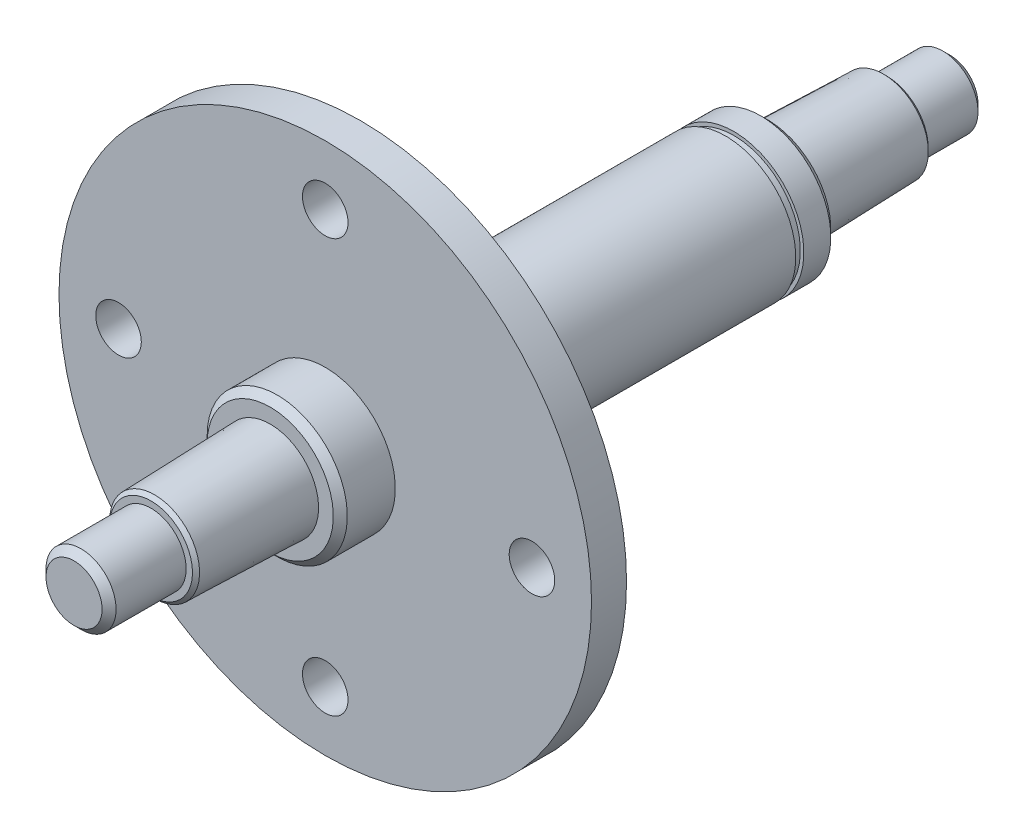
ISO-10303-21;
HEADER;
FILE_DESCRIPTION(('STEP AP214'),'2;1');
FILE_NAME('part.step','',(''),(''),'','','');
FILE_SCHEMA(('AUTOMOTIVE_DESIGN { 1 0 10303 214 1 1 1 1 }'));
ENDSEC;
DATA;
#1=APPLICATION_CONTEXT('core data for automotive mechanical design processes');
#2=APPLICATION_PROTOCOL_DEFINITION('international standard','automotive_design',2000,#1);
#3=PRODUCT_CONTEXT('',#1,'mechanical');
#4=PRODUCT('Part','Part','',(#3));
#5=PRODUCT_RELATED_PRODUCT_CATEGORY('part','',(#4));
#6=PRODUCT_DEFINITION_FORMATION('','',#4);
#7=PRODUCT_DEFINITION_CONTEXT('part definition',#1,'design');
#8=PRODUCT_DEFINITION('design','',#6,#7);
#9=PRODUCT_DEFINITION_SHAPE('','',#8);
#10=(LENGTH_UNIT() NAMED_UNIT(*) SI_UNIT(.MILLI.,.METRE.));
#11=(NAMED_UNIT(*) PLANE_ANGLE_UNIT() SI_UNIT($,.RADIAN.));
#12=(NAMED_UNIT(*) SI_UNIT($,.STERADIAN.) SOLID_ANGLE_UNIT());
#13=UNCERTAINTY_MEASURE_WITH_UNIT(LENGTH_MEASURE(1.E-05),#10,'distance_accuracy_value','');
#14=(GEOMETRIC_REPRESENTATION_CONTEXT(3) GLOBAL_UNCERTAINTY_ASSIGNED_CONTEXT((#13)) GLOBAL_UNIT_ASSIGNED_CONTEXT((#10,
#11,#12)) REPRESENTATION_CONTEXT('',''));
#15=CARTESIAN_POINT('',(0.,0.,0.));
#16=DIRECTION('',(0.,0.,1.));
#17=DIRECTION('',(1.,0.,0.));
#18=AXIS2_PLACEMENT_3D('',#15,#16,#17);
#19=CARTESIAN_POINT('',(616.610838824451,139.850859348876,-65.503302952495));
#20=DIRECTION('',(0.,0.,-1.));
#21=DIRECTION('',(-1.,0.,0.));
#22=AXIS2_PLACEMENT_3D('',#19,#20,#21);
#23=CYLINDRICAL_SURFACE('',#22,5.);
#24=CARTESIAN_POINT('',(616.610838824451,139.850859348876,-60.503302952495));
#25=DIRECTION('',(0.,0.,-1.));
#26=DIRECTION('',(-1.,0.,0.));
#27=AXIS2_PLACEMENT_3D('',#24,#25,#26);
#28=CIRCLE('',#27,5.);
#29=CARTESIAN_POINT('',(611.610838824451,139.850859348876,-60.503302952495));
#30=VERTEX_POINT('',#29);
#31=EDGE_CURVE('E10',#30,#30,#28,.F.);
#32=ORIENTED_EDGE('',*,*,#31,.T.);
#33=EDGE_LOOP('',(#32));
#34=FACE_BOUND('',#33,.T.);
#35=CARTESIAN_POINT('',(616.610838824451,139.850859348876,-52.5033029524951));
#36=DIRECTION('',(0.,0.,-1.));
#37=DIRECTION('',(-1.,0.,0.));
#38=AXIS2_PLACEMENT_3D('',#35,#36,#37);
#39=CIRCLE('',#38,5.);
#40=CARTESIAN_POINT('',(611.610838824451,139.850859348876,-52.5033029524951));
#41=VERTEX_POINT('',#40);
#42=EDGE_CURVE('E34',#41,#41,#39,.T.);
#43=ORIENTED_EDGE('',*,*,#42,.T.);
#44=EDGE_LOOP('',(#43));
#45=FACE_BOUND('',#44,.T.);
#46=ADVANCED_FACE('F14',(#34,#45),#23,.T.);
#47=CARTESIAN_POINT('',(616.610838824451,139.850859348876,-65.503302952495));
#48=DIRECTION('',(0.,0.,-1.));
#49=DIRECTION('',(-1.,0.,0.));
#50=AXIS2_PLACEMENT_3D('',#47,#48,#49);
#51=CYLINDRICAL_SURFACE('',#50,5.);
#52=CARTESIAN_POINT('',(616.610838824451,139.850859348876,62.49999999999));
#53=DIRECTION('',(0.,0.,1.));
#54=DIRECTION('',(1.,0.,0.));
#55=AXIS2_PLACEMENT_3D('',#52,#53,#54);
#56=CIRCLE('',#55,5.);
#57=CARTESIAN_POINT('',(621.610838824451,139.850859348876,62.49999999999));
#58=VERTEX_POINT('',#57);
#59=EDGE_CURVE('E29',#58,#58,#56,.F.);
#60=ORIENTED_EDGE('',*,*,#59,.T.);
#61=EDGE_LOOP('',(#60));
#62=FACE_BOUND('',#61,.T.);
#63=CARTESIAN_POINT('',(616.610838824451,139.850859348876,52.4999999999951));
#64=DIRECTION('',(0.,0.,-1.));
#65=DIRECTION('',(-1.,0.,0.));
#66=AXIS2_PLACEMENT_3D('',#63,#64,#65);
#67=CIRCLE('',#66,5.);
#68=CARTESIAN_POINT('',(611.610838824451,139.850859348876,52.4999999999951));
#69=VERTEX_POINT('',#68);
#70=EDGE_CURVE('E54',#69,#69,#67,.T.);
#71=ORIENTED_EDGE('',*,*,#70,.F.);
#72=EDGE_LOOP('',(#71));
#73=FACE_BOUND('',#72,.T.);
#74=ADVANCED_FACE('F169',(#62,#73),#51,.T.);
#75=CARTESIAN_POINT('',(616.610838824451,139.850859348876,-52.5033029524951));
#76=DIRECTION('',(0.,0.,1.));
#77=DIRECTION('',(1.,0.,0.));
#78=AXIS2_PLACEMENT_3D('',#75,#76,#77);
#79=CONICAL_SURFACE('',#78,5.,1.56712639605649);
#80=CARTESIAN_POINT('',(616.610838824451,139.850859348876,-52.5000000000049));
#81=DIRECTION('',(0.,0.,-1.));
#82=DIRECTION('',(-1.,0.,0.));
#83=AXIS2_PLACEMENT_3D('',#80,#81,#82);
#84=CIRCLE('',#83,5.89999999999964);
#85=CARTESIAN_POINT('',(610.710838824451,139.850859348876,-52.5000000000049));
#86=VERTEX_POINT('',#85);
#87=EDGE_CURVE('E51',#86,#86,#84,.T.);
#88=ORIENTED_EDGE('',*,*,#87,.T.);
#89=EDGE_LOOP('',(#88));
#90=FACE_BOUND('',#89,.T.);
#91=ORIENTED_EDGE('',*,*,#42,.F.);
#92=EDGE_LOOP('',(#91));
#93=FACE_BOUND('',#92,.T.);
#94=ADVANCED_FACE('F16',(#90,#93),#79,.T.);
#95=CARTESIAN_POINT('',(616.610838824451,52.6125551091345,52.4999999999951));
#96=DIRECTION('',(0.,0.,1.));
#97=DIRECTION('',(1.,0.,0.));
#98=AXIS2_PLACEMENT_3D('',#95,#96,#97);
#99=PLANE('',#98);
#100=ORIENTED_EDGE('',*,*,#70,.T.);
#101=EDGE_LOOP('',(#100));
#102=FACE_BOUND('',#101,.T.);
#103=CARTESIAN_POINT('',(616.610838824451,139.850859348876,52.4999999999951));
#104=DIRECTION('',(0.,0.,-1.));
#105=DIRECTION('',(-1.,0.,0.));
#106=AXIS2_PLACEMENT_3D('',#103,#104,#105);
#107=CIRCLE('',#106,5.89999999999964);
#108=CARTESIAN_POINT('',(610.710838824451,139.850859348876,52.4999999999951));
#109=VERTEX_POINT('',#108);
#110=EDGE_CURVE('E57',#109,#109,#107,.T.);
#111=ORIENTED_EDGE('',*,*,#110,.F.);
#112=EDGE_LOOP('',(#111));
#113=FACE_BOUND('',#112,.T.);
#114=ADVANCED_FACE('F177',(#102,#113),#99,.T.);
#115=CARTESIAN_POINT('',(616.610838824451,139.850859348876,52.0002161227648));
#116=DIRECTION('',(0.,0.,-1.));
#117=DIRECTION('',(-1.,0.,0.));
#118=AXIS2_PLACEMENT_3D('',#115,#116,#117);
#119=CONICAL_SURFACE('',#118,6.41469952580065,0.800099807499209);
#120=ORIENTED_EDGE('',*,*,#110,.T.);
#121=EDGE_LOOP('',(#120));
#122=FACE_BOUND('',#121,.T.);
#123=CARTESIAN_POINT('',(616.610838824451,139.850859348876,52.0002161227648));
#124=DIRECTION('',(0.,0.,-1.));
#125=DIRECTION('',(-1.,0.,0.));
#126=AXIS2_PLACEMENT_3D('',#123,#124,#125);
#127=CIRCLE('',#126,6.41469952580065);
#128=CARTESIAN_POINT('',(610.19613929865,139.850859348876,52.0002161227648));
#129=VERTEX_POINT('',#128);
#130=EDGE_CURVE('E60',#129,#129,#127,.T.);
#131=ORIENTED_EDGE('',*,*,#130,.F.);
#132=EDGE_LOOP('',(#131));
#133=FACE_BOUND('',#132,.T.);
#134=ADVANCED_FACE('F180',(#122,#133),#119,.T.);
#135=CARTESIAN_POINT('',(616.610838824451,139.850859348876,35.499999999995));
#136=DIRECTION('',(0.,0.,-1.));
#137=DIRECTION('',(-1.,0.,0.));
#138=AXIS2_PLACEMENT_3D('',#135,#136,#137);
#139=CONICAL_SURFACE('',#138,6.89999999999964,0.0294032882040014);
#140=ORIENTED_EDGE('',*,*,#130,.T.);
#141=EDGE_LOOP('',(#140));
#142=FACE_BOUND('',#141,.T.);
#143=CARTESIAN_POINT('',(616.610838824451,139.850859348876,35.499999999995));
#144=DIRECTION('',(0.,0.,-1.));
#145=DIRECTION('',(-1.,0.,0.));
#146=AXIS2_PLACEMENT_3D('',#143,#144,#145);
#147=CIRCLE('',#146,6.89999999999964);
#148=CARTESIAN_POINT('',(609.710838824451,139.850859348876,35.499999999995));
#149=VERTEX_POINT('',#148);
#150=EDGE_CURVE('E63',#149,#149,#147,.T.);
#151=ORIENTED_EDGE('',*,*,#150,.F.);
#152=EDGE_LOOP('',(#151));
#153=FACE_BOUND('',#152,.T.);
#154=ADVANCED_FACE('F184',(#142,#153),#139,.T.);
#155=CARTESIAN_POINT('',(616.610838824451,52.6125551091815,35.499999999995));
#156=DIRECTION('',(0.,0.,1.));
#157=DIRECTION('',(1.,0.,0.));
#158=AXIS2_PLACEMENT_3D('',#155,#156,#157);
#159=PLANE('',#158);
#160=ORIENTED_EDGE('',*,*,#150,.T.);
#161=EDGE_LOOP('',(#160));
#162=FACE_BOUND('',#161,.T.);
#163=CARTESIAN_POINT('',(616.610838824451,139.850859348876,35.4999999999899));
#164=DIRECTION('',(0.,0.,-1.));
#165=DIRECTION('',(-1.,0.,0.));
#166=AXIS2_PLACEMENT_3D('',#163,#164,#165);
#167=CIRCLE('',#166,9.);
#168=CARTESIAN_POINT('',(607.610838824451,139.850859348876,35.4999999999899));
#169=VERTEX_POINT('',#168);
#170=EDGE_CURVE('E66',#169,#169,#167,.T.);
#171=ORIENTED_EDGE('',*,*,#170,.F.);
#172=EDGE_LOOP('',(#171));
#173=FACE_BOUND('',#172,.T.);
#174=ADVANCED_FACE('F188',(#162,#173),#159,.T.);
#175=CARTESIAN_POINT('',(616.610838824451,139.850859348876,35.4999999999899));
#176=DIRECTION('',(0.,0.,-1.));
#177=DIRECTION('',(-1.,0.,0.));
#178=AXIS2_PLACEMENT_3D('',#175,#176,#177);
#179=CONICAL_SURFACE('',#178,9.,0.785398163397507);
#180=CARTESIAN_POINT('',(616.610838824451,139.850859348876,34.49999999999));
#181=DIRECTION('',(0.,0.,-1.));
#182=DIRECTION('',(-1.,0.,0.));
#183=AXIS2_PLACEMENT_3D('',#180,#181,#182);
#184=CIRCLE('',#183,10.);
#185=CARTESIAN_POINT('',(606.610838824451,139.850859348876,34.49999999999));
#186=VERTEX_POINT('',#185);
#187=EDGE_CURVE('E69',#186,#186,#184,.T.);
#188=ORIENTED_EDGE('',*,*,#187,.F.);
#189=EDGE_LOOP('',(#188));
#190=FACE_BOUND('',#189,.T.);
#191=ORIENTED_EDGE('',*,*,#170,.T.);
#192=EDGE_LOOP('',(#191));
#193=FACE_BOUND('',#192,.T.);
#194=ADVANCED_FACE('F192',(#190,#193),#179,.T.);
#195=CARTESIAN_POINT('',(616.610838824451,139.850859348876,-65.503302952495));
#196=DIRECTION('',(0.,0.,-1.));
#197=DIRECTION('',(-1.,0.,0.));
#198=AXIS2_PLACEMENT_3D('',#195,#196,#197);
#199=CYLINDRICAL_SURFACE('',#198,9.99999999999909);
#200=CARTESIAN_POINT('',(616.610838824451,139.850859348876,27.649999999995));
#201=DIRECTION('',(0.,0.,-1.));
#202=DIRECTION('',(-1.,0.,0.));
#203=AXIS2_PLACEMENT_3D('',#200,#201,#202);
#204=CIRCLE('',#203,9.99999999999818);
#205=CARTESIAN_POINT('',(606.610838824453,139.850859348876,27.649999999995));
#206=VERTEX_POINT('',#205);
#207=EDGE_CURVE('E72',#206,#206,#204,.T.);
#208=ORIENTED_EDGE('',*,*,#207,.F.);
#209=EDGE_LOOP('',(#208));
#210=FACE_BOUND('',#209,.T.);
#211=ORIENTED_EDGE('',*,*,#187,.T.);
#212=EDGE_LOOP('',(#211));
#213=FACE_BOUND('',#212,.T.);
#214=ADVANCED_FACE('F138',(#210,#213),#199,.T.);
#215=CARTESIAN_POINT('',(616.610838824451,52.6125551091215,27.649999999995));
#216=DIRECTION('',(0.,0.,1.));
#217=DIRECTION('',(1.,0.,0.));
#218=AXIS2_PLACEMENT_3D('',#215,#216,#217);
#219=PLANE('',#218);
#220=CARTESIAN_POINT('',(646.110838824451,139.850859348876,27.649999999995));
#221=DIRECTION('',(0.,0.,1.));
#222=DIRECTION('',(0.,-1.,0.));
#223=AXIS2_PLACEMENT_3D('',#220,#221,#222);
#224=CIRCLE('',#223,3.25);
#225=CARTESIAN_POINT('',(646.110838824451,136.600859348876,27.649999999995));
#226=VERTEX_POINT('',#225);
#227=EDGE_CURVE('E39',#226,#226,#224,.T.);
#228=ORIENTED_EDGE('',*,*,#227,.F.);
#229=EDGE_LOOP('',(#228));
#230=FACE_BOUND('',#229,.T.);
#231=CARTESIAN_POINT('',(616.610838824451,110.350859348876,27.649999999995));
#232=DIRECTION('',(0.,0.,1.));
#233=DIRECTION('',(-1.,0.,0.));
#234=AXIS2_PLACEMENT_3D('',#231,#232,#233);
#235=CIRCLE('',#234,3.25);
#236=CARTESIAN_POINT('',(613.360838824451,110.350859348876,27.649999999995));
#237=VERTEX_POINT('',#236);
#238=EDGE_CURVE('E38',#237,#237,#235,.T.);
#239=ORIENTED_EDGE('',*,*,#238,.F.);
#240=EDGE_LOOP('',(#239));
#241=FACE_BOUND('',#240,.T.);
#242=CARTESIAN_POINT('',(587.110838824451,139.850859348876,27.649999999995));
#243=DIRECTION('',(0.,0.,1.));
#244=DIRECTION('',(0.,1.,0.));
#245=AXIS2_PLACEMENT_3D('',#242,#243,#244);
#246=CIRCLE('',#245,3.25);
#247=CARTESIAN_POINT('',(587.110838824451,143.100859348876,27.649999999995));
#248=VERTEX_POINT('',#247);
#249=EDGE_CURVE('E43',#248,#248,#246,.T.);
#250=ORIENTED_EDGE('',*,*,#249,.F.);
#251=EDGE_LOOP('',(#250));
#252=FACE_BOUND('',#251,.T.);
#253=CARTESIAN_POINT('',(616.610838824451,169.350859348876,27.649999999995));
#254=DIRECTION('',(0.,0.,1.));
#255=DIRECTION('',(1.,0.,0.));
#256=AXIS2_PLACEMENT_3D('',#253,#254,#255);
#257=CIRCLE('',#256,3.25);
#258=CARTESIAN_POINT('',(619.860838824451,169.350859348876,27.649999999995));
#259=VERTEX_POINT('',#258);
#260=EDGE_CURVE('E47',#259,#259,#257,.T.);
#261=ORIENTED_EDGE('',*,*,#260,.F.);
#262=EDGE_LOOP('',(#261));
#263=FACE_BOUND('',#262,.T.);
#264=ORIENTED_EDGE('',*,*,#207,.T.);
#265=EDGE_LOOP('',(#264));
#266=FACE_BOUND('',#265,.T.);
#267=CARTESIAN_POINT('',(616.610838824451,139.850859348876,27.649999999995));
#268=DIRECTION('',(0.,0.,-1.));
#269=DIRECTION('',(-1.,0.,0.));
#270=AXIS2_PLACEMENT_3D('',#267,#268,#269);
#271=CIRCLE('',#270,38.);
#272=CARTESIAN_POINT('',(578.610838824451,139.850859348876,27.6499999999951));
#273=VERTEX_POINT('',#272);
#274=EDGE_CURVE('E75',#273,#273,#271,.T.);
#275=ORIENTED_EDGE('',*,*,#274,.F.);
#276=EDGE_LOOP('',(#275));
#277=FACE_BOUND('',#276,.T.);
#278=ADVANCED_FACE('F134',(#230,#241,#252,#263,#266,#277),#219,.T.);
#279=CARTESIAN_POINT('',(616.610838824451,139.850859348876,-65.503302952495));
#280=DIRECTION('',(0.,0.,-1.));
#281=DIRECTION('',(-1.,0.,0.));
#282=AXIS2_PLACEMENT_3D('',#279,#280,#281);
#283=CYLINDRICAL_SURFACE('',#282,38.);
#284=ORIENTED_EDGE('',*,*,#274,.T.);
#285=EDGE_LOOP('',(#284));
#286=FACE_BOUND('',#285,.T.);
#287=CARTESIAN_POINT('',(616.610838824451,139.850859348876,22.649999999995));
#288=DIRECTION('',(0.,0.,-1.));
#289=DIRECTION('',(-1.,0.,0.));
#290=AXIS2_PLACEMENT_3D('',#287,#288,#289);
#291=CIRCLE('',#290,38.);
#292=CARTESIAN_POINT('',(578.610838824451,139.850859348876,22.649999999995));
#293=VERTEX_POINT('',#292);
#294=EDGE_CURVE('E78',#293,#293,#291,.T.);
#295=ORIENTED_EDGE('',*,*,#294,.F.);
#296=EDGE_LOOP('',(#295));
#297=FACE_BOUND('',#296,.T.);
#298=ADVANCED_FACE('F137',(#286,#297),#283,.T.);
#299=CARTESIAN_POINT('',(616.610838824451,52.6125551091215,22.649999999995));
#300=DIRECTION('',(0.,0.,1.));
#301=DIRECTION('',(1.,0.,0.));
#302=AXIS2_PLACEMENT_3D('',#299,#300,#301);
#303=PLANE('',#302);
#304=CARTESIAN_POINT('',(646.110838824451,139.850859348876,22.649999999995));
#305=DIRECTION('',(0.,0.,1.));
#306=DIRECTION('',(1.,0.,0.));
#307=AXIS2_PLACEMENT_3D('',#304,#305,#306);
#308=CIRCLE('',#307,3.25);
#309=CARTESIAN_POINT('',(649.360838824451,139.850859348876,22.649999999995));
#310=VERTEX_POINT('',#309);
#311=EDGE_CURVE('E35',#310,#310,#308,.T.);
#312=ORIENTED_EDGE('',*,*,#311,.T.);
#313=EDGE_LOOP('',(#312));
#314=FACE_BOUND('',#313,.T.);
#315=CARTESIAN_POINT('',(616.610838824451,110.350859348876,22.649999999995));
#316=DIRECTION('',(0.,0.,1.));
#317=DIRECTION('',(1.,0.,0.));
#318=AXIS2_PLACEMENT_3D('',#315,#316,#317);
#319=CIRCLE('',#318,3.25);
#320=CARTESIAN_POINT('',(619.860838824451,110.350859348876,22.649999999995));
#321=VERTEX_POINT('',#320);
#322=EDGE_CURVE('E40',#321,#321,#319,.T.);
#323=ORIENTED_EDGE('',*,*,#322,.T.);
#324=EDGE_LOOP('',(#323));
#325=FACE_BOUND('',#324,.T.);
#326=CARTESIAN_POINT('',(587.110838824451,139.850859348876,22.649999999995));
#327=DIRECTION('',(0.,0.,1.));
#328=DIRECTION('',(1.,0.,0.));
#329=AXIS2_PLACEMENT_3D('',#326,#327,#328);
#330=CIRCLE('',#329,3.25);
#331=CARTESIAN_POINT('',(590.360838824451,139.850859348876,22.649999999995));
#332=VERTEX_POINT('',#331);
#333=EDGE_CURVE('E44',#332,#332,#330,.T.);
#334=ORIENTED_EDGE('',*,*,#333,.T.);
#335=EDGE_LOOP('',(#334));
#336=FACE_BOUND('',#335,.T.);
#337=CARTESIAN_POINT('',(616.610838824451,169.350859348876,22.649999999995));
#338=DIRECTION('',(0.,0.,1.));
#339=DIRECTION('',(1.,0.,0.));
#340=AXIS2_PLACEMENT_3D('',#337,#338,#339);
#341=CIRCLE('',#340,3.25);
#342=CARTESIAN_POINT('',(619.860838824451,169.350859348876,22.649999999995));
#343=VERTEX_POINT('',#342);
#344=EDGE_CURVE('E48',#343,#343,#341,.T.);
#345=ORIENTED_EDGE('',*,*,#344,.T.);
#346=EDGE_LOOP('',(#345));
#347=FACE_BOUND('',#346,.T.);
#348=CARTESIAN_POINT('',(616.610838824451,139.850859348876,22.649999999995));
#349=DIRECTION('',(0.,0.,-1.));
#350=DIRECTION('',(-1.,0.,0.));
#351=AXIS2_PLACEMENT_3D('',#348,#349,#350);
#352=CIRCLE('',#351,10.);
#353=CARTESIAN_POINT('',(606.610838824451,139.850859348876,22.649999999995));
#354=VERTEX_POINT('',#353);
#355=EDGE_CURVE('E81',#354,#354,#352,.T.);
#356=ORIENTED_EDGE('',*,*,#355,.F.);
#357=EDGE_LOOP('',(#356));
#358=FACE_BOUND('',#357,.T.);
#359=ORIENTED_EDGE('',*,*,#294,.T.);
#360=EDGE_LOOP('',(#359));
#361=FACE_BOUND('',#360,.T.);
#362=ADVANCED_FACE('F152',(#314,#325,#336,#347,#358,#361),#303,.F.);
#363=CARTESIAN_POINT('',(616.610838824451,139.850859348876,-65.503302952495));
#364=DIRECTION('',(0.,0.,-1.));
#365=DIRECTION('',(-1.,0.,0.));
#366=AXIS2_PLACEMENT_3D('',#363,#364,#365);
#367=CYLINDRICAL_SURFACE('',#366,10.);
#368=CARTESIAN_POINT('',(616.610838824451,139.850859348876,17.6499999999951));
#369=DIRECTION('',(0.,0.,-1.));
#370=DIRECTION('',(-1.,0.,0.));
#371=AXIS2_PLACEMENT_3D('',#368,#369,#370);
#372=CIRCLE('',#371,10.);
#373=CARTESIAN_POINT('',(606.610838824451,139.850859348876,17.6499999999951));
#374=VERTEX_POINT('',#373);
#375=EDGE_CURVE('E84',#374,#374,#372,.T.);
#376=ORIENTED_EDGE('',*,*,#375,.F.);
#377=EDGE_LOOP('',(#376));
#378=FACE_BOUND('',#377,.T.);
#379=ORIENTED_EDGE('',*,*,#355,.T.);
#380=EDGE_LOOP('',(#379));
#381=FACE_BOUND('',#380,.T.);
#382=ADVANCED_FACE('F157',(#378,#381),#367,.T.);
#383=CARTESIAN_POINT('',(616.610838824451,52.6125551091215,17.6499999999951));
#384=DIRECTION('',(0.,0.,1.));
#385=DIRECTION('',(1.,0.,0.));
#386=AXIS2_PLACEMENT_3D('',#383,#384,#385);
#387=PLANE('',#386);
#388=CARTESIAN_POINT('',(616.610838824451,139.850859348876,17.6499999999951));
#389=DIRECTION('',(0.,0.,-1.));
#390=DIRECTION('',(-1.,0.,0.));
#391=AXIS2_PLACEMENT_3D('',#388,#389,#390);
#392=CIRCLE('',#391,9.5);
#393=CARTESIAN_POINT('',(607.110838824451,139.850859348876,17.6499999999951));
#394=VERTEX_POINT('',#393);
#395=EDGE_CURVE('E87',#394,#394,#392,.T.);
#396=ORIENTED_EDGE('',*,*,#395,.F.);
#397=EDGE_LOOP('',(#396));
#398=FACE_BOUND('',#397,.T.);
#399=ORIENTED_EDGE('',*,*,#375,.T.);
#400=EDGE_LOOP('',(#399));
#401=FACE_BOUND('',#400,.T.);
#402=ADVANCED_FACE('F164',(#398,#401),#387,.F.);
#403=CARTESIAN_POINT('',(616.610838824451,139.850859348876,-65.503302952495));
#404=DIRECTION('',(0.,0.,-1.));
#405=DIRECTION('',(-1.,0.,0.));
#406=AXIS2_PLACEMENT_3D('',#403,#404,#405);
#407=CYLINDRICAL_SURFACE('',#406,9.5);
#408=CARTESIAN_POINT('',(616.610838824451,139.850859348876,16.4999999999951));
#409=DIRECTION('',(0.,0.,-1.));
#410=DIRECTION('',(-1.,0.,0.));
#411=AXIS2_PLACEMENT_3D('',#408,#409,#410);
#412=CIRCLE('',#411,9.5);
#413=CARTESIAN_POINT('',(607.110838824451,139.850859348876,16.4999999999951));
#414=VERTEX_POINT('',#413);
#415=EDGE_CURVE('E90',#414,#414,#412,.T.);
#416=ORIENTED_EDGE('',*,*,#415,.F.);
#417=EDGE_LOOP('',(#416));
#418=FACE_BOUND('',#417,.T.);
#419=ORIENTED_EDGE('',*,*,#395,.T.);
#420=EDGE_LOOP('',(#419));
#421=FACE_BOUND('',#420,.T.);
#422=ADVANCED_FACE('F244',(#418,#421),#407,.T.);
#423=CARTESIAN_POINT('',(616.610838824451,52.6125551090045,16.5));
#424=DIRECTION('',(0.,0.,1.));
#425=DIRECTION('',(1.,0.,0.));
#426=AXIS2_PLACEMENT_3D('',#423,#424,#425);
#427=PLANE('',#426);
#428=ORIENTED_EDGE('',*,*,#415,.T.);
#429=EDGE_LOOP('',(#428));
#430=FACE_BOUND('',#429,.T.);
#431=CARTESIAN_POINT('',(616.610838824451,139.850859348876,16.5));
#432=DIRECTION('',(0.,0.,-1.));
#433=DIRECTION('',(-1.,0.,0.));
#434=AXIS2_PLACEMENT_3D('',#431,#432,#433);
#435=CIRCLE('',#434,10.);
#436=CARTESIAN_POINT('',(606.610838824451,139.850859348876,16.5));
#437=VERTEX_POINT('',#436);
#438=EDGE_CURVE('E93',#437,#437,#435,.T.);
#439=ORIENTED_EDGE('',*,*,#438,.F.);
#440=EDGE_LOOP('',(#439));
#441=FACE_BOUND('',#440,.T.);
#442=ADVANCED_FACE('F254',(#430,#441),#427,.T.);
#443=CARTESIAN_POINT('',(616.610838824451,139.850859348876,-65.503302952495));
#444=DIRECTION('',(0.,0.,-1.));
#445=DIRECTION('',(-1.,0.,0.));
#446=AXIS2_PLACEMENT_3D('',#443,#444,#445);
#447=CYLINDRICAL_SURFACE('',#446,10.);
#448=CARTESIAN_POINT('',(616.610838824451,139.850859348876,-29.5000000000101));
#449=DIRECTION('',(0.,0.,-1.));
#450=DIRECTION('',(-1.,0.,0.));
#451=AXIS2_PLACEMENT_3D('',#448,#449,#450);
#452=CIRCLE('',#451,10.);
#453=CARTESIAN_POINT('',(606.610838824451,139.850859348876,-29.5000000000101));
#454=VERTEX_POINT('',#453);
#455=EDGE_CURVE('E96',#454,#454,#452,.T.);
#456=ORIENTED_EDGE('',*,*,#455,.F.);
#457=EDGE_LOOP('',(#456));
#458=FACE_BOUND('',#457,.T.);
#459=ORIENTED_EDGE('',*,*,#438,.T.);
#460=EDGE_LOOP('',(#459));
#461=FACE_BOUND('',#460,.T.);
#462=ADVANCED_FACE('F264',(#458,#461),#447,.T.);
#463=CARTESIAN_POINT('',(616.610838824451,52.612555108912,-29.5000000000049));
#464=DIRECTION('',(0.,0.,1.));
#465=DIRECTION('',(1.,0.,0.));
#466=AXIS2_PLACEMENT_3D('',#463,#464,#465);
#467=PLANE('',#466);
#468=CARTESIAN_POINT('',(616.610838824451,139.850859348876,-29.5000000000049));
#469=DIRECTION('',(0.,0.,-1.));
#470=DIRECTION('',(-1.,0.,0.));
#471=AXIS2_PLACEMENT_3D('',#468,#469,#470);
#472=CIRCLE('',#471,9.5);
#473=CARTESIAN_POINT('',(607.110838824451,139.850859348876,-29.5000000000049));
#474=VERTEX_POINT('',#473);
#475=EDGE_CURVE('E99',#474,#474,#472,.T.);
#476=ORIENTED_EDGE('',*,*,#475,.F.);
#477=EDGE_LOOP('',(#476));
#478=FACE_BOUND('',#477,.T.);
#479=ORIENTED_EDGE('',*,*,#455,.T.);
#480=EDGE_LOOP('',(#479));
#481=FACE_BOUND('',#480,.T.);
#482=ADVANCED_FACE('F275',(#478,#481),#467,.F.);
#483=CARTESIAN_POINT('',(616.610838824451,139.850859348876,-65.503302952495));
#484=DIRECTION('',(0.,0.,-1.));
#485=DIRECTION('',(-1.,0.,0.));
#486=AXIS2_PLACEMENT_3D('',#483,#484,#485);
#487=CYLINDRICAL_SURFACE('',#486,9.5);
#488=CARTESIAN_POINT('',(616.610838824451,139.850859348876,-30.650000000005));
#489=DIRECTION('',(0.,0.,-1.));
#490=DIRECTION('',(-1.,0.,0.));
#491=AXIS2_PLACEMENT_3D('',#488,#489,#490);
#492=CIRCLE('',#491,9.5);
#493=CARTESIAN_POINT('',(607.110838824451,139.850859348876,-30.650000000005));
#494=VERTEX_POINT('',#493);
#495=EDGE_CURVE('E102',#494,#494,#492,.T.);
#496=ORIENTED_EDGE('',*,*,#495,.F.);
#497=EDGE_LOOP('',(#496));
#498=FACE_BOUND('',#497,.T.);
#499=ORIENTED_EDGE('',*,*,#475,.T.);
#500=EDGE_LOOP('',(#499));
#501=FACE_BOUND('',#500,.T.);
#502=ADVANCED_FACE('F285',(#498,#501),#487,.T.);
#503=CARTESIAN_POINT('',(616.610838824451,52.6125551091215,-30.650000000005));
#504=DIRECTION('',(0.,0.,-1.));
#505=DIRECTION('',(-1.,0.,0.));
#506=AXIS2_PLACEMENT_3D('',#503,#504,#505);
#507=PLANE('',#506);
#508=CARTESIAN_POINT('',(616.610838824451,139.850859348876,-30.650000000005));
#509=DIRECTION('',(0.,0.,-1.));
#510=DIRECTION('',(-1.,0.,0.));
#511=AXIS2_PLACEMENT_3D('',#508,#509,#510);
#512=CIRCLE('',#511,10.);
#513=CARTESIAN_POINT('',(606.610838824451,139.850859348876,-30.650000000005));
#514=VERTEX_POINT('',#513);
#515=EDGE_CURVE('E105',#514,#514,#512,.T.);
#516=ORIENTED_EDGE('',*,*,#515,.F.);
#517=EDGE_LOOP('',(#516));
#518=FACE_BOUND('',#517,.T.);
#519=ORIENTED_EDGE('',*,*,#495,.T.);
#520=EDGE_LOOP('',(#519));
#521=FACE_BOUND('',#520,.T.);
#522=ADVANCED_FACE('F295',(#518,#521),#507,.F.);
#523=CARTESIAN_POINT('',(616.610838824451,139.850859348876,-65.503302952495));
#524=DIRECTION('',(0.,0.,-1.));
#525=DIRECTION('',(-1.,0.,0.));
#526=AXIS2_PLACEMENT_3D('',#523,#524,#525);
#527=CYLINDRICAL_SURFACE('',#526,10.);
#528=CARTESIAN_POINT('',(616.610838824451,139.850859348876,-34.5000000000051));
#529=DIRECTION('',(0.,0.,-1.));
#530=DIRECTION('',(-1.,0.,0.));
#531=AXIS2_PLACEMENT_3D('',#528,#529,#530);
#532=CIRCLE('',#531,10.);
#533=CARTESIAN_POINT('',(606.610838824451,139.850859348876,-34.5000000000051));
#534=VERTEX_POINT('',#533);
#535=EDGE_CURVE('E108',#534,#534,#532,.T.);
#536=ORIENTED_EDGE('',*,*,#535,.F.);
#537=EDGE_LOOP('',(#536));
#538=FACE_BOUND('',#537,.T.);
#539=ORIENTED_EDGE('',*,*,#515,.T.);
#540=EDGE_LOOP('',(#539));
#541=FACE_BOUND('',#540,.T.);
#542=ADVANCED_FACE('F305',(#538,#541),#527,.T.);
#543=CARTESIAN_POINT('',(616.610838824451,139.850859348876,-34.5000000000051));
#544=DIRECTION('',(0.,0.,1.));
#545=DIRECTION('',(1.,0.,0.));
#546=AXIS2_PLACEMENT_3D('',#543,#544,#545);
#547=CONICAL_SURFACE('',#546,10.,0.785398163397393);
#548=CARTESIAN_POINT('',(616.610838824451,139.850859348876,-35.500000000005));
#549=DIRECTION('',(0.,0.,-1.));
#550=DIRECTION('',(-1.,0.,0.));
#551=AXIS2_PLACEMENT_3D('',#548,#549,#550);
#552=CIRCLE('',#551,9.);
#553=CARTESIAN_POINT('',(607.610838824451,139.850859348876,-35.500000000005));
#554=VERTEX_POINT('',#553);
#555=EDGE_CURVE('E111',#554,#554,#552,.T.);
#556=ORIENTED_EDGE('',*,*,#555,.F.);
#557=EDGE_LOOP('',(#556));
#558=FACE_BOUND('',#557,.T.);
#559=ORIENTED_EDGE('',*,*,#535,.T.);
#560=EDGE_LOOP('',(#559));
#561=FACE_BOUND('',#560,.T.);
#562=ADVANCED_FACE('F315',(#558,#561),#547,.T.);
#563=CARTESIAN_POINT('',(616.610838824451,52.6125551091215,-35.500000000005));
#564=DIRECTION('',(0.,0.,1.));
#565=DIRECTION('',(1.,0.,0.));
#566=AXIS2_PLACEMENT_3D('',#563,#564,#565);
#567=PLANE('',#566);
#568=CARTESIAN_POINT('',(616.610838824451,139.850859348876,-35.500000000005));
#569=DIRECTION('',(0.,0.,-1.));
#570=DIRECTION('',(-1.,0.,0.));
#571=AXIS2_PLACEMENT_3D('',#568,#569,#570);
#572=CIRCLE('',#571,6.89999999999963);
#573=CARTESIAN_POINT('',(609.710838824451,139.850859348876,-35.500000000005));
#574=VERTEX_POINT('',#573);
#575=EDGE_CURVE('E114',#574,#574,#572,.T.);
#576=ORIENTED_EDGE('',*,*,#575,.F.);
#577=EDGE_LOOP('',(#576));
#578=FACE_BOUND('',#577,.T.);
#579=ORIENTED_EDGE('',*,*,#555,.T.);
#580=EDGE_LOOP('',(#579));
#581=FACE_BOUND('',#580,.T.);
#582=ADVANCED_FACE('F325',(#578,#581),#567,.F.);
#583=CARTESIAN_POINT('',(616.610838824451,139.850859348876,-35.500000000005));
#584=DIRECTION('',(0.,0.,1.));
#585=DIRECTION('',(1.,0.,0.));
#586=AXIS2_PLACEMENT_3D('',#583,#584,#585);
#587=CONICAL_SURFACE('',#586,6.89999999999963,0.0294032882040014);
#588=CARTESIAN_POINT('',(616.610838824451,139.850859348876,-52.0002161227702));
#589=DIRECTION('',(0.,0.,-1.));
#590=DIRECTION('',(-1.,0.,0.));
#591=AXIS2_PLACEMENT_3D('',#588,#589,#590);
#592=CIRCLE('',#591,6.41469952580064);
#593=CARTESIAN_POINT('',(610.19613929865,139.850859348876,-52.0002161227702));
#594=VERTEX_POINT('',#593);
#595=EDGE_CURVE('E117',#594,#594,#592,.T.);
#596=ORIENTED_EDGE('',*,*,#595,.F.);
#597=EDGE_LOOP('',(#596));
#598=FACE_BOUND('',#597,.T.);
#599=ORIENTED_EDGE('',*,*,#575,.T.);
#600=EDGE_LOOP('',(#599));
#601=FACE_BOUND('',#600,.T.);
#602=ADVANCED_FACE('F335',(#598,#601),#587,.T.);
#603=CARTESIAN_POINT('',(616.610838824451,139.850859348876,-52.0002161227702));
#604=DIRECTION('',(0.,0.,1.));
#605=DIRECTION('',(1.,0.,0.));
#606=AXIS2_PLACEMENT_3D('',#603,#604,#605);
#607=CONICAL_SURFACE('',#606,6.41469952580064,0.800099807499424);
#608=ORIENTED_EDGE('',*,*,#87,.F.);
#609=EDGE_LOOP('',(#608));
#610=FACE_BOUND('',#609,.T.);
#611=ORIENTED_EDGE('',*,*,#595,.T.);
#612=EDGE_LOOP('',(#611));
#613=FACE_BOUND('',#612,.T.);
#614=ADVANCED_FACE('F345',(#610,#613),#607,.T.);
#615=CARTESIAN_POINT('',(616.610838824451,169.350859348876,-65.503302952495));
#616=DIRECTION('',(0.,0.,1.));
#617=DIRECTION('',(1.,0.,0.));
#618=AXIS2_PLACEMENT_3D('',#615,#616,#617);
#619=CYLINDRICAL_SURFACE('',#618,3.25);
#620=ORIENTED_EDGE('',*,*,#260,.T.);
#621=EDGE_LOOP('',(#620));
#622=FACE_BOUND('',#621,.T.);
#623=ORIENTED_EDGE('',*,*,#344,.F.);
#624=EDGE_LOOP('',(#623));
#625=FACE_BOUND('',#624,.T.);
#626=ADVANCED_FACE('F355',(#622,#625),#619,.F.);
#627=CARTESIAN_POINT('',(587.110838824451,139.850859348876,-65.503302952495));
#628=DIRECTION('',(0.,0.,1.));
#629=DIRECTION('',(1.,0.,0.));
#630=AXIS2_PLACEMENT_3D('',#627,#628,#629);
#631=CYLINDRICAL_SURFACE('',#630,3.25);
#632=ORIENTED_EDGE('',*,*,#249,.T.);
#633=EDGE_LOOP('',(#632));
#634=FACE_BOUND('',#633,.T.);
#635=ORIENTED_EDGE('',*,*,#333,.F.);
#636=EDGE_LOOP('',(#635));
#637=FACE_BOUND('',#636,.T.);
#638=ADVANCED_FACE('F365',(#634,#637),#631,.F.);
#639=CARTESIAN_POINT('',(616.610838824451,110.350859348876,-65.503302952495));
#640=DIRECTION('',(0.,0.,1.));
#641=DIRECTION('',(1.,0.,0.));
#642=AXIS2_PLACEMENT_3D('',#639,#640,#641);
#643=CYLINDRICAL_SURFACE('',#642,3.25);
#644=ORIENTED_EDGE('',*,*,#238,.T.);
#645=EDGE_LOOP('',(#644));
#646=FACE_BOUND('',#645,.T.);
#647=ORIENTED_EDGE('',*,*,#322,.F.);
#648=EDGE_LOOP('',(#647));
#649=FACE_BOUND('',#648,.T.);
#650=ADVANCED_FACE('F375',(#646,#649),#643,.F.);
#651=CARTESIAN_POINT('',(646.110838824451,139.850859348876,-65.503302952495));
#652=DIRECTION('',(0.,0.,1.));
#653=DIRECTION('',(1.,0.,0.));
#654=AXIS2_PLACEMENT_3D('',#651,#652,#653);
#655=CYLINDRICAL_SURFACE('',#654,3.25);
#656=ORIENTED_EDGE('',*,*,#227,.T.);
#657=EDGE_LOOP('',(#656));
#658=FACE_BOUND('',#657,.T.);
#659=ORIENTED_EDGE('',*,*,#311,.F.);
#660=EDGE_LOOP('',(#659));
#661=FACE_BOUND('',#660,.T.);
#662=ADVANCED_FACE('F131',(#658,#661),#655,.F.);
#663=CARTESIAN_POINT('',(616.610838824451,139.850859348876,63.49999999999));
#664=DIRECTION('',(0.,0.,1.));
#665=DIRECTION('',(1.,0.,0.));
#666=AXIS2_PLACEMENT_3D('',#663,#664,#665);
#667=PLANE('',#666);
#668=CARTESIAN_POINT('',(616.610838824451,139.850859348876,63.49999999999));
#669=DIRECTION('',(0.,0.,1.));
#670=DIRECTION('',(1.,0.,0.));
#671=AXIS2_PLACEMENT_3D('',#668,#669,#670);
#672=CIRCLE('',#671,4.);
#673=CARTESIAN_POINT('',(620.610838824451,139.850859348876,63.49999999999));
#674=VERTEX_POINT('',#673);
#675=EDGE_CURVE('E25',#674,#674,#672,.T.);
#676=ORIENTED_EDGE('',*,*,#675,.T.);
#677=EDGE_LOOP('',(#676));
#678=FACE_BOUND('',#677,.T.);
#679=ADVANCED_FACE('F394',(#678),#667,.T.);
#680=CARTESIAN_POINT('',(616.837379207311,140.694738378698,-61.503302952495));
#681=DIRECTION('',(0.,0.,-1.));
#682=DIRECTION('',(-1.,0.,0.));
#683=AXIS2_PLACEMENT_3D('',#680,#681,#682);
#684=PLANE('',#683);
#685=CARTESIAN_POINT('',(616.610838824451,139.850859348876,-61.503302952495));
#686=DIRECTION('',(0.,0.,-1.));
#687=DIRECTION('',(-1.,0.,0.));
#688=AXIS2_PLACEMENT_3D('',#685,#686,#687);
#689=CIRCLE('',#688,4.);
#690=CARTESIAN_POINT('',(612.610838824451,139.850859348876,-61.503302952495));
#691=VERTEX_POINT('',#690);
#692=EDGE_CURVE('E21',#691,#691,#689,.T.);
#693=ORIENTED_EDGE('',*,*,#692,.T.);
#694=EDGE_LOOP('',(#693));
#695=FACE_BOUND('',#694,.T.);
#696=ADVANCED_FACE('F403',(#695),#684,.T.);
#697=CARTESIAN_POINT('',(616.610838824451,139.850859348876,62.49999999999));
#698=DIRECTION('',(0.,0.,-1.));
#699=DIRECTION('',(-1.,0.,0.));
#700=AXIS2_PLACEMENT_3D('',#697,#698,#699);
#701=CONICAL_SURFACE('',#700,5.,0.785398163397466);
#702=ORIENTED_EDGE('',*,*,#675,.F.);
#703=EDGE_LOOP('',(#702));
#704=FACE_BOUND('',#703,.T.);
#705=ORIENTED_EDGE('',*,*,#59,.F.);
#706=EDGE_LOOP('',(#705));
#707=FACE_BOUND('',#706,.T.);
#708=ADVANCED_FACE('F413',(#704,#707),#701,.T.);
#709=CARTESIAN_POINT('',(616.610838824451,139.850859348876,-61.503302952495));
#710=DIRECTION('',(0.,0.,1.));
#711=DIRECTION('',(1.,0.,0.));
#712=AXIS2_PLACEMENT_3D('',#709,#710,#711);
#713=CONICAL_SURFACE('',#712,4.,0.785398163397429);
#714=ORIENTED_EDGE('',*,*,#31,.F.);
#715=EDGE_LOOP('',(#714));
#716=FACE_BOUND('',#715,.T.);
#717=ORIENTED_EDGE('',*,*,#692,.F.);
#718=EDGE_LOOP('',(#717));
#719=FACE_BOUND('',#718,.T.);
#720=ADVANCED_FACE('F422',(#716,#719),#713,.T.);
#721=CLOSED_SHELL('',(#46,#74,#94,#114,#134,#154,#174,#194,#214,#278,#298,#362,#382,#402,#422,
#442,#462,#482,#502,#522,#542,#562,#582,#602,#614,#626,#638,#650,#662,#679,#696,#708,#720));
#722=MANIFOLD_SOLID_BREP('B1',#721);
#723=ADVANCED_BREP_SHAPE_REPRESENTATION('',(#18,#722),#14);
#724=SHAPE_DEFINITION_REPRESENTATION(#9,#723);
ENDSEC;
END-ISO-10303-21;
